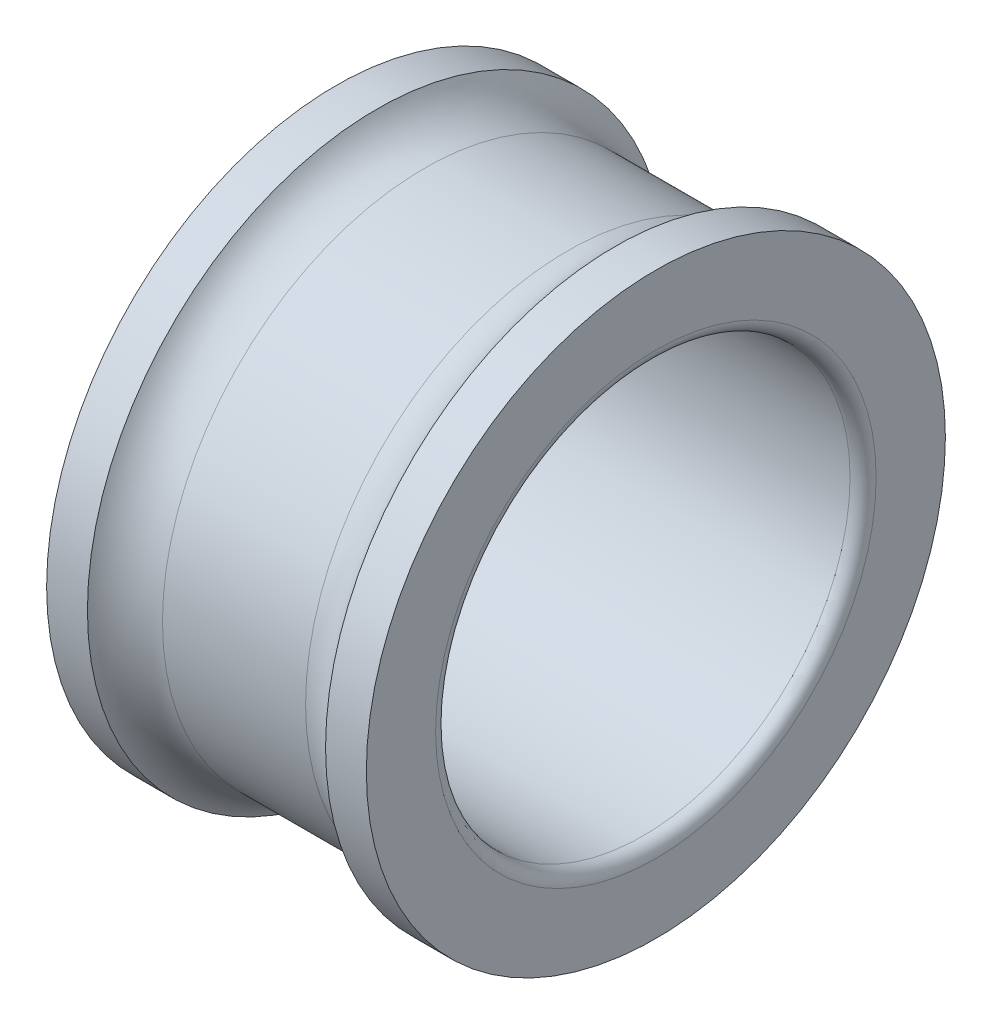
ISO-10303-21;
HEADER;
FILE_DESCRIPTION(('STEP AP214'),'2;1');
FILE_NAME('part.step','',(''),(''),'','','');
FILE_SCHEMA(('AUTOMOTIVE_DESIGN { 1 0 10303 214 1 1 1 1 }'));
ENDSEC;
DATA;
#1=APPLICATION_CONTEXT('core data for automotive mechanical design processes');
#2=APPLICATION_PROTOCOL_DEFINITION('international standard','automotive_design',2000,#1);
#3=PRODUCT_CONTEXT('',#1,'mechanical');
#4=PRODUCT('Part','Part','',(#3));
#5=PRODUCT_RELATED_PRODUCT_CATEGORY('part','',(#4));
#6=PRODUCT_DEFINITION_FORMATION('','',#4);
#7=PRODUCT_DEFINITION_CONTEXT('part definition',#1,'design');
#8=PRODUCT_DEFINITION('design','',#6,#7);
#9=PRODUCT_DEFINITION_SHAPE('','',#8);
#10=(LENGTH_UNIT() NAMED_UNIT(*) SI_UNIT(.MILLI.,.METRE.));
#11=(NAMED_UNIT(*) PLANE_ANGLE_UNIT() SI_UNIT($,.RADIAN.));
#12=(NAMED_UNIT(*) SI_UNIT($,.STERADIAN.) SOLID_ANGLE_UNIT());
#13=UNCERTAINTY_MEASURE_WITH_UNIT(LENGTH_MEASURE(1.E-05),#10,'distance_accuracy_value','');
#14=(GEOMETRIC_REPRESENTATION_CONTEXT(3) GLOBAL_UNCERTAINTY_ASSIGNED_CONTEXT((#13)) GLOBAL_UNIT_ASSIGNED_CONTEXT((#10,
#11,#12)) REPRESENTATION_CONTEXT('',''));
#15=CARTESIAN_POINT('',(0.,0.,0.));
#16=DIRECTION('',(0.,0.,1.));
#17=DIRECTION('',(1.,0.,0.));
#18=AXIS2_PLACEMENT_3D('',#15,#16,#17);
#19=CARTESIAN_POINT('',(-12.4,0.,0.));
#20=DIRECTION('',(-1.,0.,0.));
#21=DIRECTION('',(0.,0.,1.));
#22=AXIS2_PLACEMENT_3D('',#19,#20,#21);
#23=TOROIDAL_SURFACE('',#22,18.6,1.1);
#24=CARTESIAN_POINT('',(-12.4,0.,0.));
#25=DIRECTION('',(-1.,0.,0.));
#26=DIRECTION('',(0.,0.,1.));
#27=AXIS2_PLACEMENT_3D('',#24,#25,#26);
#28=CIRCLE('',#27,17.5);
#29=CARTESIAN_POINT('',(-12.4,0.,17.5));
#30=VERTEX_POINT('',#29);
#31=EDGE_CURVE('E10',#30,#30,#28,.T.);
#32=ORIENTED_EDGE('',*,*,#31,.F.);
#33=EDGE_LOOP('',(#32));
#34=FACE_BOUND('',#33,.T.);
#35=CARTESIAN_POINT('',(-13.5,0.,0.));
#36=DIRECTION('',(-1.,0.,0.));
#37=DIRECTION('',(0.,0.,1.));
#38=AXIS2_PLACEMENT_3D('',#35,#36,#37);
#39=CIRCLE('',#38,18.6);
#40=CARTESIAN_POINT('',(-13.5,0.,18.6));
#41=VERTEX_POINT('',#40);
#42=EDGE_CURVE('E64',#41,#41,#39,.T.);
#43=ORIENTED_EDGE('',*,*,#42,.T.);
#44=EDGE_LOOP('',(#43));
#45=FACE_BOUND('',#44,.T.);
#46=ADVANCED_FACE('F30',(#34,#45),#23,.T.);
#47=CARTESIAN_POINT('',(0.,0.,0.));
#48=DIRECTION('',(-1.,0.,0.));
#49=DIRECTION('',(0.,0.,1.));
#50=AXIS2_PLACEMENT_3D('',#47,#48,#49);
#51=CYLINDRICAL_SURFACE('',#50,17.5);
#52=CARTESIAN_POINT('',(12.4,0.,0.));
#53=DIRECTION('',(-1.,0.,0.));
#54=DIRECTION('',(0.,0.,1.));
#55=AXIS2_PLACEMENT_3D('',#52,#53,#54);
#56=CIRCLE('',#55,17.5);
#57=CARTESIAN_POINT('',(12.4,0.,17.5));
#58=VERTEX_POINT('',#57);
#59=EDGE_CURVE('E36',#58,#58,#56,.T.);
#60=ORIENTED_EDGE('',*,*,#59,.F.);
#61=EDGE_LOOP('',(#60));
#62=FACE_BOUND('',#61,.T.);
#63=ORIENTED_EDGE('',*,*,#31,.T.);
#64=EDGE_LOOP('',(#63));
#65=FACE_BOUND('',#64,.T.);
#66=ADVANCED_FACE('F113',(#62,#65),#51,.F.);
#67=CARTESIAN_POINT('',(12.4,0.,0.));
#68=DIRECTION('',(-1.,0.,0.));
#69=DIRECTION('',(0.,0.,1.));
#70=AXIS2_PLACEMENT_3D('',#67,#68,#69);
#71=TOROIDAL_SURFACE('',#70,18.6,1.1);
#72=CARTESIAN_POINT('',(13.5,0.,0.));
#73=DIRECTION('',(-1.,0.,0.));
#74=DIRECTION('',(0.,0.,1.));
#75=AXIS2_PLACEMENT_3D('',#72,#73,#74);
#76=CIRCLE('',#75,18.6);
#77=CARTESIAN_POINT('',(13.5,0.,18.6));
#78=VERTEX_POINT('',#77);
#79=EDGE_CURVE('E40',#78,#78,#76,.T.);
#80=ORIENTED_EDGE('',*,*,#79,.F.);
#81=EDGE_LOOP('',(#80));
#82=FACE_BOUND('',#81,.T.);
#83=ORIENTED_EDGE('',*,*,#59,.T.);
#84=EDGE_LOOP('',(#83));
#85=FACE_BOUND('',#84,.T.);
#86=ADVANCED_FACE('F108',(#82,#85),#71,.T.);
#87=CARTESIAN_POINT('',(13.5,24.45,0.));
#88=DIRECTION('',(-1.,0.,0.));
#89=DIRECTION('',(0.,0.,1.));
#90=AXIS2_PLACEMENT_3D('',#87,#88,#89);
#91=PLANE('',#90);
#92=CARTESIAN_POINT('',(13.5,0.,0.));
#93=DIRECTION('',(-1.,0.,0.));
#94=DIRECTION('',(0.,0.,1.));
#95=AXIS2_PLACEMENT_3D('',#92,#93,#94);
#96=CIRCLE('',#95,24.45);
#97=CARTESIAN_POINT('',(13.5,0.,24.4500000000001));
#98=VERTEX_POINT('',#97);
#99=EDGE_CURVE('E44',#98,#98,#96,.T.);
#100=ORIENTED_EDGE('',*,*,#99,.F.);
#101=EDGE_LOOP('',(#100));
#102=FACE_BOUND('',#101,.T.);
#103=ORIENTED_EDGE('',*,*,#79,.T.);
#104=EDGE_LOOP('',(#103));
#105=FACE_BOUND('',#104,.T.);
#106=ADVANCED_FACE('F102',(#102,#105),#91,.F.);
#107=CARTESIAN_POINT('',(0.,0.,0.));
#108=DIRECTION('',(-1.,0.,0.));
#109=DIRECTION('',(0.,0.,1.));
#110=AXIS2_PLACEMENT_3D('',#107,#108,#109);
#111=CYLINDRICAL_SURFACE('',#110,24.45);
#112=CARTESIAN_POINT('',(10.0542250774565,0.,0.));
#113=DIRECTION('',(-1.,0.,0.));
#114=DIRECTION('',(0.,0.,1.));
#115=AXIS2_PLACEMENT_3D('',#112,#113,#114);
#116=CIRCLE('',#115,24.45);
#117=CARTESIAN_POINT('',(10.0542250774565,0.,24.4500000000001));
#118=VERTEX_POINT('',#117);
#119=EDGE_CURVE('E49',#118,#118,#116,.T.);
#120=ORIENTED_EDGE('',*,*,#119,.F.);
#121=EDGE_LOOP('',(#120));
#122=FACE_BOUND('',#121,.T.);
#123=ORIENTED_EDGE('',*,*,#99,.T.);
#124=EDGE_LOOP('',(#123));
#125=FACE_BOUND('',#124,.T.);
#126=ADVANCED_FACE('F96',(#122,#125),#111,.T.);
#127=CARTESIAN_POINT('',(6.04166666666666,0.,0.));
#128=DIRECTION('',(-1.,0.,0.));
#129=DIRECTION('',(0.,0.,1.));
#130=AXIS2_PLACEMENT_3D('',#127,#128,#129);
#131=TOROIDAL_SURFACE('',#130,26.75,4.625);
#132=CARTESIAN_POINT('',(6.04166666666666,0.,0.));
#133=DIRECTION('',(-1.,0.,0.));
#134=DIRECTION('',(0.,0.,1.));
#135=AXIS2_PLACEMENT_3D('',#132,#133,#134);
#136=CIRCLE('',#135,22.125);
#137=CARTESIAN_POINT('',(6.04166666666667,0.,22.125));
#138=VERTEX_POINT('',#137);
#139=EDGE_CURVE('E52',#138,#138,#136,.T.);
#140=ORIENTED_EDGE('',*,*,#139,.F.);
#141=EDGE_LOOP('',(#140));
#142=FACE_BOUND('',#141,.T.);
#143=ORIENTED_EDGE('',*,*,#119,.T.);
#144=EDGE_LOOP('',(#143));
#145=FACE_BOUND('',#144,.T.);
#146=ADVANCED_FACE('F90',(#142,#145),#131,.F.);
#147=CARTESIAN_POINT('',(0.,0.,0.));
#148=DIRECTION('',(-1.,0.,0.));
#149=DIRECTION('',(0.,0.,1.));
#150=AXIS2_PLACEMENT_3D('',#147,#148,#149);
#151=CYLINDRICAL_SURFACE('',#150,22.125);
#152=CARTESIAN_POINT('',(-6.04166666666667,0.,0.));
#153=DIRECTION('',(-1.,0.,0.));
#154=DIRECTION('',(0.,0.,1.));
#155=AXIS2_PLACEMENT_3D('',#152,#153,#154);
#156=CIRCLE('',#155,22.125);
#157=CARTESIAN_POINT('',(-6.04166666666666,0.,22.125));
#158=VERTEX_POINT('',#157);
#159=EDGE_CURVE('E55',#158,#158,#156,.T.);
#160=ORIENTED_EDGE('',*,*,#159,.F.);
#161=EDGE_LOOP('',(#160));
#162=FACE_BOUND('',#161,.T.);
#163=ORIENTED_EDGE('',*,*,#139,.T.);
#164=EDGE_LOOP('',(#163));
#165=FACE_BOUND('',#164,.T.);
#166=ADVANCED_FACE('F84',(#162,#165),#151,.T.);
#167=CARTESIAN_POINT('',(-6.04166666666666,0.,0.));
#168=DIRECTION('',(-1.,0.,0.));
#169=DIRECTION('',(0.,0.,1.));
#170=AXIS2_PLACEMENT_3D('',#167,#168,#169);
#171=TOROIDAL_SURFACE('',#170,26.75,4.625);
#172=CARTESIAN_POINT('',(-10.0542250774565,0.,0.));
#173=DIRECTION('',(-1.,0.,0.));
#174=DIRECTION('',(0.,0.,1.));
#175=AXIS2_PLACEMENT_3D('',#172,#173,#174);
#176=CIRCLE('',#175,24.45);
#177=CARTESIAN_POINT('',(-10.0542250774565,0.,24.45));
#178=VERTEX_POINT('',#177);
#179=EDGE_CURVE('E58',#178,#178,#176,.T.);
#180=ORIENTED_EDGE('',*,*,#179,.F.);
#181=EDGE_LOOP('',(#180));
#182=FACE_BOUND('',#181,.T.);
#183=ORIENTED_EDGE('',*,*,#159,.T.);
#184=EDGE_LOOP('',(#183));
#185=FACE_BOUND('',#184,.T.);
#186=ADVANCED_FACE('F78',(#182,#185),#171,.F.);
#187=CARTESIAN_POINT('',(0.,0.,0.));
#188=DIRECTION('',(-1.,0.,0.));
#189=DIRECTION('',(0.,0.,1.));
#190=AXIS2_PLACEMENT_3D('',#187,#188,#189);
#191=CYLINDRICAL_SURFACE('',#190,24.45);
#192=CARTESIAN_POINT('',(-13.5,0.,0.));
#193=DIRECTION('',(-1.,0.,0.));
#194=DIRECTION('',(0.,0.,1.));
#195=AXIS2_PLACEMENT_3D('',#192,#193,#194);
#196=CIRCLE('',#195,24.45);
#197=CARTESIAN_POINT('',(-13.5,0.,24.45));
#198=VERTEX_POINT('',#197);
#199=EDGE_CURVE('E61',#198,#198,#196,.T.);
#200=ORIENTED_EDGE('',*,*,#199,.F.);
#201=EDGE_LOOP('',(#200));
#202=FACE_BOUND('',#201,.T.);
#203=ORIENTED_EDGE('',*,*,#179,.T.);
#204=EDGE_LOOP('',(#203));
#205=FACE_BOUND('',#204,.T.);
#206=ADVANCED_FACE('F72',(#202,#205),#191,.T.);
#207=CARTESIAN_POINT('',(-13.5,24.45,0.));
#208=DIRECTION('',(1.,0.,0.));
#209=DIRECTION('',(0.,0.,-1.));
#210=AXIS2_PLACEMENT_3D('',#207,#208,#209);
#211=PLANE('',#210);
#212=ORIENTED_EDGE('',*,*,#42,.F.);
#213=EDGE_LOOP('',(#212));
#214=FACE_BOUND('',#213,.T.);
#215=ORIENTED_EDGE('',*,*,#199,.T.);
#216=EDGE_LOOP('',(#215));
#217=FACE_BOUND('',#216,.T.);
#218=ADVANCED_FACE('F69',(#214,#217),#211,.F.);
#219=CLOSED_SHELL('',(#46,#66,#86,#106,#126,#146,#166,#186,#206,#218));
#220=MANIFOLD_SOLID_BREP('B2',#219);
#221=ADVANCED_BREP_SHAPE_REPRESENTATION('',(#18,#220),#14);
#222=SHAPE_DEFINITION_REPRESENTATION(#9,#221);
ENDSEC;
END-ISO-10303-21;
